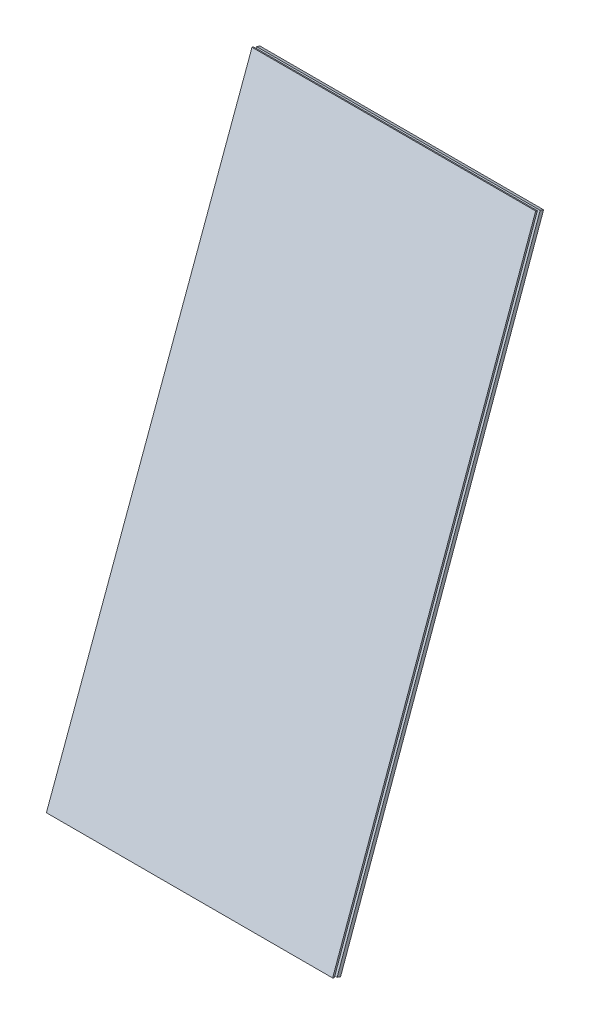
ISO-10303-21;
HEADER;
FILE_DESCRIPTION(('STEP AP214'),'2;1');
FILE_NAME('part.step','',(''),(''),'','','');
FILE_SCHEMA(('AUTOMOTIVE_DESIGN { 1 0 10303 214 1 1 1 1 }'));
ENDSEC;
DATA;
#1=APPLICATION_CONTEXT('core data for automotive mechanical design processes');
#2=APPLICATION_PROTOCOL_DEFINITION('international standard','automotive_design',2000,#1);
#3=PRODUCT_CONTEXT('',#1,'mechanical');
#4=PRODUCT('Part','Part','',(#3));
#5=PRODUCT_RELATED_PRODUCT_CATEGORY('part','',(#4));
#6=PRODUCT_DEFINITION_FORMATION('','',#4);
#7=PRODUCT_DEFINITION_CONTEXT('part definition',#1,'design');
#8=PRODUCT_DEFINITION('design','',#6,#7);
#9=PRODUCT_DEFINITION_SHAPE('','',#8);
#10=(LENGTH_UNIT() NAMED_UNIT(*) SI_UNIT(.MILLI.,.METRE.));
#11=(NAMED_UNIT(*) PLANE_ANGLE_UNIT() SI_UNIT($,.RADIAN.));
#12=(NAMED_UNIT(*) SI_UNIT($,.STERADIAN.) SOLID_ANGLE_UNIT());
#13=UNCERTAINTY_MEASURE_WITH_UNIT(LENGTH_MEASURE(1.E-05),#10,'distance_accuracy_value','');
#14=(GEOMETRIC_REPRESENTATION_CONTEXT(3) GLOBAL_UNCERTAINTY_ASSIGNED_CONTEXT((#13)) GLOBAL_UNIT_ASSIGNED_CONTEXT((#10,
#11,#12)) REPRESENTATION_CONTEXT('',''));
#15=CARTESIAN_POINT('',(0.,0.,0.));
#16=DIRECTION('',(0.,0.,1.));
#17=DIRECTION('',(1.,0.,0.));
#18=AXIS2_PLACEMENT_3D('',#15,#16,#17);
#19=CARTESIAN_POINT('',(6.99999999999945,3071.77898116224,-1062.69887121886));
#20=DIRECTION('',(0.999997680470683,-0.00202395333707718,0.000736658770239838));
#21=DIRECTION('',(0.00202395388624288,0.999997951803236,0.));
#22=AXIS2_PLACEMENT_3D('',#19,#20,#21);
#23=PLANE('',#22);
#24=DIRECTION('',(-0.00215384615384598,-0.939690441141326,0.342019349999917));
#25=VECTOR('',#24,1.);
#26=CARTESIAN_POINT('',(6.99999999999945,3068.35877972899,-1072.09579742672));
#27=LINE('',#26,#25);
#28=CARTESIAN_POINT('',(6.99999999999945,3068.35877972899,-1072.09579742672));
#29=VERTEX_POINT('',#28);
#30=CARTESIAN_POINT('',(0.,14.364846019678,39.4670900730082));
#31=VERTEX_POINT('',#30);
#32=EDGE_CURVE('E126',#29,#31,#27,.T.);
#33=ORIENTED_EDGE('',*,*,#32,.T.);
#34=DIRECTION('',(0.,-0.342020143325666,-0.939692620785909));
#35=VECTOR('',#34,1.);
#36=CARTESIAN_POINT('',(0.,17.7850474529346,48.8640162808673));
#37=LINE('',#36,#35);
#38=CARTESIAN_POINT('',(0.,17.7850474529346,48.8640162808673));
#39=VERTEX_POINT('',#38);
#40=EDGE_CURVE('E12',#39,#31,#37,.T.);
#41=ORIENTED_EDGE('',*,*,#40,.F.);
#42=DIRECTION('',(-0.00215384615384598,-0.939690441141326,0.342019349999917));
#43=VECTOR('',#42,1.);
#44=CARTESIAN_POINT('',(6.99999999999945,3071.77898116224,-1062.69887121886));
#45=LINE('',#44,#43);
#46=CARTESIAN_POINT('',(6.99999999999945,3071.77898116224,-1062.69887121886));
#47=VERTEX_POINT('',#46);
#48=EDGE_CURVE('E109',#47,#39,#45,.T.);
#49=ORIENTED_EDGE('',*,*,#48,.F.);
#50=DIRECTION('',(0.,-0.342020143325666,-0.939692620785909));
#51=VECTOR('',#50,1.);
#52=CARTESIAN_POINT('',(6.99999999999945,3071.77898116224,-1062.69887121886));
#53=LINE('',#52,#51);
#54=EDGE_CURVE('E122',#47,#29,#53,.T.);
#55=ORIENTED_EDGE('',*,*,#54,.T.);
#56=EDGE_LOOP('',(#33,#41,#49,#55));
#57=FACE_BOUND('',#56,.T.);
#58=ADVANCED_FACE('F49',(#57),#23,.F.);
#59=CARTESIAN_POINT('',(0.,17.7850474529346,48.8640162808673));
#60=DIRECTION('',(0.,0.939692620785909,-0.342020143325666));
#61=DIRECTION('',(0.,0.342020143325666,0.939692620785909));
#62=AXIS2_PLACEMENT_3D('',#59,#60,#61);
#63=PLANE('',#62);
#64=DIRECTION('',(1.,0.,0.));
#65=VECTOR('',#64,1.);
#66=CARTESIAN_POINT('',(0.,14.364846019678,39.4670900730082));
#67=LINE('',#66,#65);
#68=CARTESIAN_POINT('',(1557.,14.3648460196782,39.4670900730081));
#69=VERTEX_POINT('',#68);
#70=EDGE_CURVE('E114',#31,#69,#67,.T.);
#71=ORIENTED_EDGE('',*,*,#70,.T.);
#72=DIRECTION('',(0.,-0.342020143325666,-0.939692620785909));
#73=VECTOR('',#72,1.);
#74=CARTESIAN_POINT('',(1557.,17.7850474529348,48.8640162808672));
#75=LINE('',#74,#73);
#76=CARTESIAN_POINT('',(1557.,17.7850474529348,48.8640162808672));
#77=VERTEX_POINT('',#76);
#78=EDGE_CURVE('E58',#77,#69,#75,.T.);
#79=ORIENTED_EDGE('',*,*,#78,.F.);
#80=DIRECTION('',(1.,0.,0.));
#81=VECTOR('',#80,1.);
#82=CARTESIAN_POINT('',(0.,17.7850474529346,48.8640162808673));
#83=LINE('',#82,#81);
#84=EDGE_CURVE('E104',#39,#77,#83,.T.);
#85=ORIENTED_EDGE('',*,*,#84,.F.);
#86=ORIENTED_EDGE('',*,*,#40,.T.);
#87=EDGE_LOOP('',(#71,#79,#85,#86));
#88=FACE_BOUND('',#87,.T.);
#89=ADVANCED_FACE('F113',(#88),#63,.F.);
#90=CARTESIAN_POINT('',(1557.,17.7850474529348,48.8640162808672));
#91=DIRECTION('',(-0.999997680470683,-0.00202395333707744,0.000736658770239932));
#92=DIRECTION('',(0.00202395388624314,-0.999997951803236,0.));
#93=AXIS2_PLACEMENT_3D('',#90,#91,#92);
#94=PLANE('',#93);
#95=DIRECTION('',(-0.00215384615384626,0.939690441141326,-0.342019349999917));
#96=VECTOR('',#95,1.);
#97=CARTESIAN_POINT('',(1557.,14.3648460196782,39.4670900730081));
#98=LINE('',#97,#96);
#99=CARTESIAN_POINT('',(1550.,3068.35877972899,-1072.09579742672));
#100=VERTEX_POINT('',#99);
#101=EDGE_CURVE('E89',#69,#100,#98,.T.);
#102=ORIENTED_EDGE('',*,*,#101,.T.);
#103=DIRECTION('',(0.,-0.342020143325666,-0.939692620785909));
#104=VECTOR('',#103,1.);
#105=CARTESIAN_POINT('',(1550.,3071.77898116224,-1062.69887121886));
#106=LINE('',#105,#104);
#107=CARTESIAN_POINT('',(1550.,3071.77898116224,-1062.69887121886));
#108=VERTEX_POINT('',#107);
#109=EDGE_CURVE('E116',#108,#100,#106,.T.);
#110=ORIENTED_EDGE('',*,*,#109,.F.);
#111=DIRECTION('',(-0.00215384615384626,0.939690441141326,-0.342019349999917));
#112=VECTOR('',#111,1.);
#113=CARTESIAN_POINT('',(1557.,17.7850474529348,48.8640162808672));
#114=LINE('',#113,#112);
#115=EDGE_CURVE('E107',#77,#108,#114,.T.);
#116=ORIENTED_EDGE('',*,*,#115,.F.);
#117=ORIENTED_EDGE('',*,*,#78,.T.);
#118=EDGE_LOOP('',(#102,#110,#116,#117));
#119=FACE_BOUND('',#118,.T.);
#120=ADVANCED_FACE('F117',(#119),#94,.F.);
#121=CARTESIAN_POINT('',(1550.,3071.77898116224,-1062.69887121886));
#122=DIRECTION('',(0.,-0.939692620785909,0.342020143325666));
#123=DIRECTION('',(0.,-0.342020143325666,-0.939692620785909));
#124=AXIS2_PLACEMENT_3D('',#121,#122,#123);
#125=PLANE('',#124);
#126=DIRECTION('',(-1.,0.,0.));
#127=VECTOR('',#126,1.);
#128=CARTESIAN_POINT('',(1550.,3068.35877972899,-1072.09579742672));
#129=LINE('',#128,#127);
#130=EDGE_CURVE('E96',#100,#29,#129,.T.);
#131=ORIENTED_EDGE('',*,*,#130,.T.);
#132=ORIENTED_EDGE('',*,*,#54,.F.);
#133=DIRECTION('',(-1.,0.,0.));
#134=VECTOR('',#133,1.);
#135=CARTESIAN_POINT('',(1550.,3071.77898116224,-1062.69887121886));
#136=LINE('',#135,#134);
#137=EDGE_CURVE('E69',#108,#47,#136,.T.);
#138=ORIENTED_EDGE('',*,*,#137,.F.);
#139=ORIENTED_EDGE('',*,*,#109,.T.);
#140=EDGE_LOOP('',(#131,#132,#138,#139));
#141=FACE_BOUND('',#140,.T.);
#142=ADVANCED_FACE('F138',(#141),#125,.F.);
#143=CARTESIAN_POINT('',(0.,17.7850474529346,48.8640162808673));
#144=DIRECTION('',(0.,0.342020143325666,0.939692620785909));
#145=DIRECTION('',(0.,-0.939692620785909,0.342020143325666));
#146=AXIS2_PLACEMENT_3D('',#143,#144,#145);
#147=PLANE('',#146);
#148=ORIENTED_EDGE('',*,*,#48,.T.);
#149=ORIENTED_EDGE('',*,*,#84,.T.);
#150=ORIENTED_EDGE('',*,*,#115,.T.);
#151=ORIENTED_EDGE('',*,*,#137,.T.);
#152=EDGE_LOOP('',(#148,#149,#150,#151));
#153=FACE_BOUND('',#152,.T.);
#154=ADVANCED_FACE('F105',(#153),#147,.T.);
#155=CARTESIAN_POINT('',(0.,14.364846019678,39.4670900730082));
#156=DIRECTION('',(0.,0.342020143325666,0.939692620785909));
#157=DIRECTION('',(0.,-0.939692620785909,0.342020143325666));
#158=AXIS2_PLACEMENT_3D('',#155,#156,#157);
#159=PLANE('',#158);
#160=ORIENTED_EDGE('',*,*,#32,.F.);
#161=ORIENTED_EDGE('',*,*,#130,.F.);
#162=ORIENTED_EDGE('',*,*,#101,.F.);
#163=ORIENTED_EDGE('',*,*,#70,.F.);
#164=EDGE_LOOP('',(#160,#161,#162,#163));
#165=FACE_BOUND('',#164,.T.);
#166=ADVANCED_FACE('F141',(#165),#159,.F.);
#167=CLOSED_SHELL('',(#58,#89,#120,#142,#154,#166));
#168=MANIFOLD_SOLID_BREP('B2',#167);
#169=CARTESIAN_POINT('',(6.99999999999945,3062.88645743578,-1087.1308793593));
#170=DIRECTION('',(0.999997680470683,-0.00202395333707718,0.000736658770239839));
#171=DIRECTION('',(0.00202395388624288,0.999997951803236,0.));
#172=AXIS2_PLACEMENT_3D('',#169,#170,#171);
#173=PLANE('',#172);
#174=DIRECTION('',(-0.00215384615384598,-0.939690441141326,0.342019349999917));
#175=VECTOR('',#174,1.);
#176=CARTESIAN_POINT('',(6.99999999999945,3056.04605456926,-1105.92473177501));
#177=LINE('',#176,#175);
#178=CARTESIAN_POINT('',(6.99999999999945,3056.04605456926,-1105.92473177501));
#179=VERTEX_POINT('',#178);
#180=CARTESIAN_POINT('',(0.,2.052120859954,5.63815572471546));
#181=VERTEX_POINT('',#180);
#182=EDGE_CURVE('E275',#179,#181,#177,.T.);
#183=ORIENTED_EDGE('',*,*,#182,.T.);
#184=DIRECTION('',(0.,-0.342020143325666,-0.939692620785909));
#185=VECTOR('',#184,1.);
#186=CARTESIAN_POINT('',(0.,8.89252372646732,24.4320081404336));
#187=LINE('',#186,#185);
#188=CARTESIAN_POINT('',(0.,8.89252372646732,24.4320081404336));
#189=VERTEX_POINT('',#188);
#190=EDGE_CURVE('E47',#189,#181,#187,.T.);
#191=ORIENTED_EDGE('',*,*,#190,.F.);
#192=DIRECTION('',(-0.00215384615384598,-0.939690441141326,0.342019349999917));
#193=VECTOR('',#192,1.);
#194=CARTESIAN_POINT('',(6.99999999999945,3062.88645743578,-1087.1308793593));
#195=LINE('',#194,#193);
#196=CARTESIAN_POINT('',(6.99999999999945,3062.88645743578,-1087.1308793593));
#197=VERTEX_POINT('',#196);
#198=EDGE_CURVE('E258',#197,#189,#195,.T.);
#199=ORIENTED_EDGE('',*,*,#198,.F.);
#200=DIRECTION('',(0.,-0.342020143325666,-0.939692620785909));
#201=VECTOR('',#200,1.);
#202=CARTESIAN_POINT('',(6.99999999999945,3062.88645743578,-1087.1308793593));
#203=LINE('',#202,#201);
#204=EDGE_CURVE('E271',#197,#179,#203,.T.);
#205=ORIENTED_EDGE('',*,*,#204,.T.);
#206=EDGE_LOOP('',(#183,#191,#199,#205));
#207=FACE_BOUND('',#206,.T.);
#208=ADVANCED_FACE('F198',(#207),#173,.F.);
#209=CARTESIAN_POINT('',(0.,8.89252372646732,24.4320081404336));
#210=DIRECTION('',(0.,0.939692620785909,-0.342020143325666));
#211=DIRECTION('',(0.,0.342020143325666,0.939692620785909));
#212=AXIS2_PLACEMENT_3D('',#209,#210,#211);
#213=PLANE('',#212);
#214=DIRECTION('',(1.,0.,0.));
#215=VECTOR('',#214,1.);
#216=CARTESIAN_POINT('',(0.,2.052120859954,5.63815572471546));
#217=LINE('',#216,#215);
#218=CARTESIAN_POINT('',(1557.,2.05212085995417,5.6381557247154));
#219=VERTEX_POINT('',#218);
#220=EDGE_CURVE('E263',#181,#219,#217,.T.);
#221=ORIENTED_EDGE('',*,*,#220,.T.);
#222=DIRECTION('',(0.,-0.342020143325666,-0.939692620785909));
#223=VECTOR('',#222,1.);
#224=CARTESIAN_POINT('',(1557.,8.89252372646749,24.4320081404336));
#225=LINE('',#224,#223);
#226=CARTESIAN_POINT('',(1557.,8.89252372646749,24.4320081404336));
#227=VERTEX_POINT('',#226);
#228=EDGE_CURVE('E207',#227,#219,#225,.T.);
#229=ORIENTED_EDGE('',*,*,#228,.F.);
#230=DIRECTION('',(1.,0.,0.));
#231=VECTOR('',#230,1.);
#232=CARTESIAN_POINT('',(0.,8.89252372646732,24.4320081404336));
#233=LINE('',#232,#231);
#234=EDGE_CURVE('E253',#189,#227,#233,.T.);
#235=ORIENTED_EDGE('',*,*,#234,.F.);
#236=ORIENTED_EDGE('',*,*,#190,.T.);
#237=EDGE_LOOP('',(#221,#229,#235,#236));
#238=FACE_BOUND('',#237,.T.);
#239=ADVANCED_FACE('F262',(#238),#213,.F.);
#240=CARTESIAN_POINT('',(1557.,8.89252372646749,24.4320081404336));
#241=DIRECTION('',(-0.999997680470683,-0.00202395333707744,0.000736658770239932));
#242=DIRECTION('',(0.00202395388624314,-0.999997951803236,0.));
#243=AXIS2_PLACEMENT_3D('',#240,#241,#242);
#244=PLANE('',#243);
#245=DIRECTION('',(-0.00215384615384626,0.939690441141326,-0.342019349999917));
#246=VECTOR('',#245,1.);
#247=CARTESIAN_POINT('',(1557.,2.05212085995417,5.6381557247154));
#248=LINE('',#247,#246);
#249=CARTESIAN_POINT('',(1550.,3056.04605456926,-1105.92473177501));
#250=VERTEX_POINT('',#249);
#251=EDGE_CURVE('E238',#219,#250,#248,.T.);
#252=ORIENTED_EDGE('',*,*,#251,.T.);
#253=DIRECTION('',(0.,-0.342020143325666,-0.939692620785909));
#254=VECTOR('',#253,1.);
#255=CARTESIAN_POINT('',(1550.,3062.88645743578,-1087.1308793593));
#256=LINE('',#255,#254);
#257=CARTESIAN_POINT('',(1550.,3062.88645743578,-1087.1308793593));
#258=VERTEX_POINT('',#257);
#259=EDGE_CURVE('E265',#258,#250,#256,.T.);
#260=ORIENTED_EDGE('',*,*,#259,.F.);
#261=DIRECTION('',(-0.00215384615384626,0.939690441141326,-0.342019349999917));
#262=VECTOR('',#261,1.);
#263=CARTESIAN_POINT('',(1557.,8.89252372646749,24.4320081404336));
#264=LINE('',#263,#262);
#265=EDGE_CURVE('E256',#227,#258,#264,.T.);
#266=ORIENTED_EDGE('',*,*,#265,.F.);
#267=ORIENTED_EDGE('',*,*,#228,.T.);
#268=EDGE_LOOP('',(#252,#260,#266,#267));
#269=FACE_BOUND('',#268,.T.);
#270=ADVANCED_FACE('F266',(#269),#244,.F.);
#271=CARTESIAN_POINT('',(1550.,3062.88645743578,-1087.1308793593));
#272=DIRECTION('',(0.,-0.939692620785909,0.342020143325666));
#273=DIRECTION('',(0.,-0.342020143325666,-0.939692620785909));
#274=AXIS2_PLACEMENT_3D('',#271,#272,#273);
#275=PLANE('',#274);
#276=DIRECTION('',(-1.,0.,0.));
#277=VECTOR('',#276,1.);
#278=CARTESIAN_POINT('',(1550.,3056.04605456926,-1105.92473177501));
#279=LINE('',#278,#277);
#280=EDGE_CURVE('E245',#250,#179,#279,.T.);
#281=ORIENTED_EDGE('',*,*,#280,.T.);
#282=ORIENTED_EDGE('',*,*,#204,.F.);
#283=DIRECTION('',(-1.,0.,0.));
#284=VECTOR('',#283,1.);
#285=CARTESIAN_POINT('',(1550.,3062.88645743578,-1087.1308793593));
#286=LINE('',#285,#284);
#287=EDGE_CURVE('E218',#258,#197,#286,.T.);
#288=ORIENTED_EDGE('',*,*,#287,.F.);
#289=ORIENTED_EDGE('',*,*,#259,.T.);
#290=EDGE_LOOP('',(#281,#282,#288,#289));
#291=FACE_BOUND('',#290,.T.);
#292=ADVANCED_FACE('F287',(#291),#275,.F.);
#293=CARTESIAN_POINT('',(0.,8.89252372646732,24.4320081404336));
#294=DIRECTION('',(0.,0.342020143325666,0.939692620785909));
#295=DIRECTION('',(0.,-0.939692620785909,0.342020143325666));
#296=AXIS2_PLACEMENT_3D('',#293,#294,#295);
#297=PLANE('',#296);
#298=ORIENTED_EDGE('',*,*,#198,.T.);
#299=ORIENTED_EDGE('',*,*,#234,.T.);
#300=ORIENTED_EDGE('',*,*,#265,.T.);
#301=ORIENTED_EDGE('',*,*,#287,.T.);
#302=EDGE_LOOP('',(#298,#299,#300,#301));
#303=FACE_BOUND('',#302,.T.);
#304=ADVANCED_FACE('F254',(#303),#297,.T.);
#305=CARTESIAN_POINT('',(0.,2.052120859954,5.63815572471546));
#306=DIRECTION('',(0.,0.342020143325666,0.939692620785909));
#307=DIRECTION('',(0.,-0.939692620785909,0.342020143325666));
#308=AXIS2_PLACEMENT_3D('',#305,#306,#307);
#309=PLANE('',#308);
#310=ORIENTED_EDGE('',*,*,#182,.F.);
#311=ORIENTED_EDGE('',*,*,#280,.F.);
#312=ORIENTED_EDGE('',*,*,#251,.F.);
#313=ORIENTED_EDGE('',*,*,#220,.F.);
#314=EDGE_LOOP('',(#310,#311,#312,#313));
#315=FACE_BOUND('',#314,.T.);
#316=ADVANCED_FACE('F290',(#315),#309,.F.);
#317=CLOSED_SHELL('',(#208,#239,#270,#292,#304,#316));
#318=MANIFOLD_SOLID_BREP('B6',#317);
#319=ADVANCED_BREP_SHAPE_REPRESENTATION('',(#18,#168,#318),#14);
#320=SHAPE_DEFINITION_REPRESENTATION(#9,#319);
ENDSEC;
END-ISO-10303-21;
